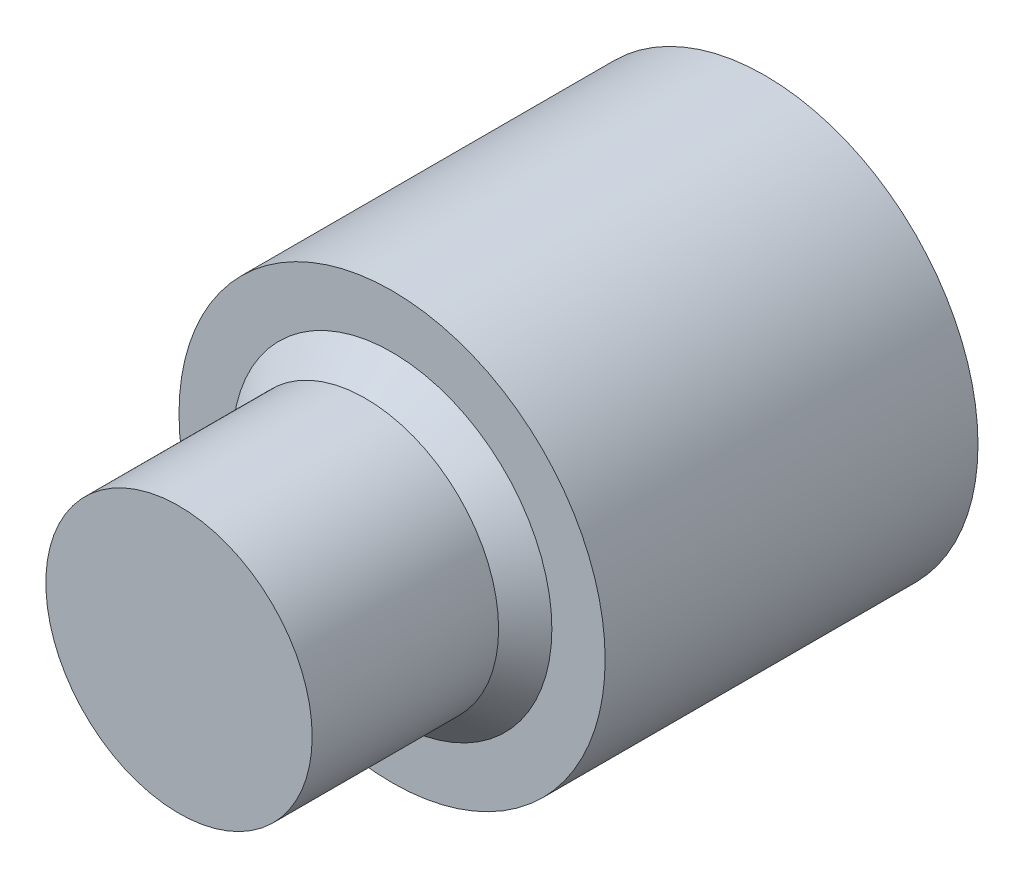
from build123d import *

# Parameters (mm, degrees)
IZIM1_R                     = 4
Y_KSEKLIK_EKSTR_ZYON1_DEPTH = 7
IZIM2_R                     = 3
Y_KSEKLIK_EKSTR_ZYON2_DEPTH = 0.5
Y_KSEKLIK_EKSTR_ZYON2_TAPER = 45
IZIM3_R                     = 2.5
Y_KSEKLIK_EKSTR_ZYON3_DEPTH = 3.5


with BuildPart() as part:
    # izim1 → Y_kseklik-Ekstr_zyon1 (new body)
    with BuildSketch(Plane.XY):
        Circle(IZIM1_R)
    extrude(amount=Y_KSEKLIK_EKSTR_ZYON1_DEPTH)

    # izim2 → Y_kseklik-Ekstr_zyon2 (add)
    with BuildSketch(Plane.XY.offset(7)):
        Circle(IZIM2_R)
    extrude(amount=Y_KSEKLIK_EKSTR_ZYON2_DEPTH, taper=Y_KSEKLIK_EKSTR_ZYON2_TAPER)

    # izim3 → Y_kseklik-Ekstr_zyon3 (add)
    with BuildSketch(Plane.XY.offset(7.5)):
        Circle(IZIM3_R)
    extrude(amount=Y_KSEKLIK_EKSTR_ZYON3_DEPTH)


solid = part.part
